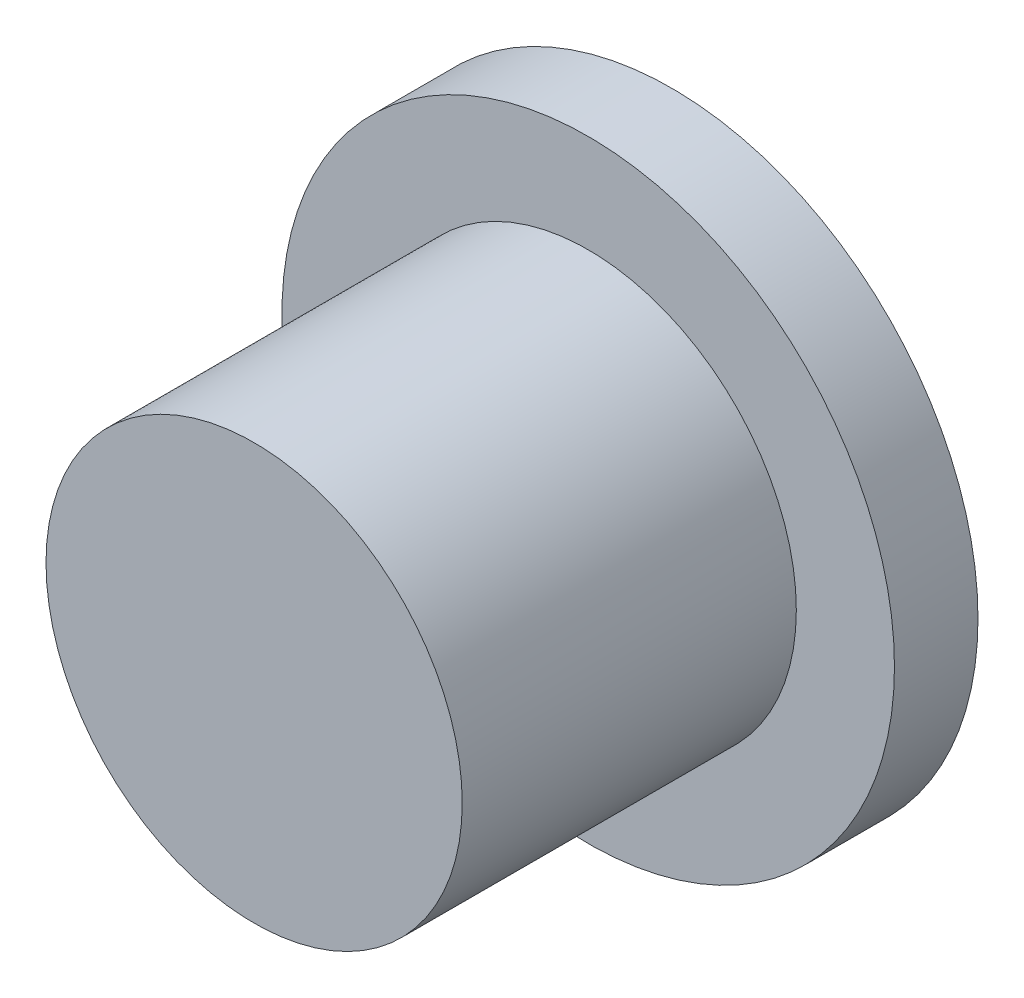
ISO-10303-21;
HEADER;
FILE_DESCRIPTION(('STEP AP214'),'2;1');
FILE_NAME('part.step','',(''),(''),'','','');
FILE_SCHEMA(('AUTOMOTIVE_DESIGN { 1 0 10303 214 1 1 1 1 }'));
ENDSEC;
DATA;
#1=APPLICATION_CONTEXT('core data for automotive mechanical design processes');
#2=APPLICATION_PROTOCOL_DEFINITION('international standard','automotive_design',2000,#1);
#3=PRODUCT_CONTEXT('',#1,'mechanical');
#4=PRODUCT('Part','Part','',(#3));
#5=PRODUCT_RELATED_PRODUCT_CATEGORY('part','',(#4));
#6=PRODUCT_DEFINITION_FORMATION('','',#4);
#7=PRODUCT_DEFINITION_CONTEXT('part definition',#1,'design');
#8=PRODUCT_DEFINITION('design','',#6,#7);
#9=PRODUCT_DEFINITION_SHAPE('','',#8);
#10=(LENGTH_UNIT() NAMED_UNIT(*) SI_UNIT(.MILLI.,.METRE.));
#11=(NAMED_UNIT(*) PLANE_ANGLE_UNIT() SI_UNIT($,.RADIAN.));
#12=(NAMED_UNIT(*) SI_UNIT($,.STERADIAN.) SOLID_ANGLE_UNIT());
#13=UNCERTAINTY_MEASURE_WITH_UNIT(LENGTH_MEASURE(1.E-05),#10,'distance_accuracy_value','');
#14=(GEOMETRIC_REPRESENTATION_CONTEXT(3) GLOBAL_UNCERTAINTY_ASSIGNED_CONTEXT((#13)) GLOBAL_UNIT_ASSIGNED_CONTEXT((#10,
#11,#12)) REPRESENTATION_CONTEXT('',''));
#15=CARTESIAN_POINT('',(0.,0.,0.));
#16=DIRECTION('',(0.,0.,1.));
#17=DIRECTION('',(1.,0.,0.));
#18=AXIS2_PLACEMENT_3D('',#15,#16,#17);
#19=CARTESIAN_POINT('',(0.,11.,-3.));
#20=DIRECTION('',(0.,0.,1.));
#21=DIRECTION('',(1.,0.,0.));
#22=AXIS2_PLACEMENT_3D('',#19,#20,#21);
#23=PLANE('',#22);
#24=CARTESIAN_POINT('',(0.,0.,-3.));
#25=DIRECTION('',(0.,0.,1.));
#26=DIRECTION('',(1.,0.,0.));
#27=AXIS2_PLACEMENT_3D('',#24,#25,#26);
#28=CIRCLE('',#27,11.);
#29=CARTESIAN_POINT('',(11.,0.,-3.));
#30=VERTEX_POINT('',#29);
#31=EDGE_CURVE('E141',#30,#30,#28,.T.);
#32=ORIENTED_EDGE('',*,*,#31,.F.);
#33=EDGE_LOOP('',(#32));
#34=FACE_BOUND('',#33,.T.);
#35=DIRECTION('',(-0.866025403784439,0.5,0.));
#36=VECTOR('',#35,1.);
#37=CARTESIAN_POINT('',(4.,2.3094010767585,-3.));
#38=LINE('',#37,#36);
#39=CARTESIAN_POINT('',(4.,2.3094010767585,-3.));
#40=VERTEX_POINT('',#39);
#41=CARTESIAN_POINT('',(0.,4.61880215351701,-3.));
#42=VERTEX_POINT('',#41);
#43=EDGE_CURVE('E50',#40,#42,#38,.T.);
#44=ORIENTED_EDGE('',*,*,#43,.T.);
#45=DIRECTION('',(-0.866025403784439,-0.5,0.));
#46=VECTOR('',#45,1.);
#47=CARTESIAN_POINT('',(0.,4.61880215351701,-3.));
#48=LINE('',#47,#46);
#49=CARTESIAN_POINT('',(-4.,2.3094010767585,-3.));
#50=VERTEX_POINT('',#49);
#51=EDGE_CURVE('E121',#42,#50,#48,.T.);
#52=ORIENTED_EDGE('',*,*,#51,.T.);
#53=DIRECTION('',(0.,-1.,0.));
#54=VECTOR('',#53,1.);
#55=CARTESIAN_POINT('',(-4.,2.3094010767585,-3.));
#56=LINE('',#55,#54);
#57=CARTESIAN_POINT('',(-4.,-2.3094010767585,-3.));
#58=VERTEX_POINT('',#57);
#59=EDGE_CURVE('E124',#50,#58,#56,.T.);
#60=ORIENTED_EDGE('',*,*,#59,.T.);
#61=DIRECTION('',(0.866025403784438,-0.5,0.));
#62=VECTOR('',#61,1.);
#63=CARTESIAN_POINT('',(-4.,-2.3094010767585,-3.));
#64=LINE('',#63,#62);
#65=CARTESIAN_POINT('',(0.,-4.61880215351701,-3.));
#66=VERTEX_POINT('',#65);
#67=EDGE_CURVE('E127',#58,#66,#64,.T.);
#68=ORIENTED_EDGE('',*,*,#67,.T.);
#69=DIRECTION('',(0.866025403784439,0.5,0.));
#70=VECTOR('',#69,1.);
#71=CARTESIAN_POINT('',(0.,-4.61880215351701,-3.));
#72=LINE('',#71,#70);
#73=CARTESIAN_POINT('',(4.,-2.3094010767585,-3.));
#74=VERTEX_POINT('',#73);
#75=EDGE_CURVE('E111',#66,#74,#72,.T.);
#76=ORIENTED_EDGE('',*,*,#75,.T.);
#77=DIRECTION('',(0.,1.,0.));
#78=VECTOR('',#77,1.);
#79=CARTESIAN_POINT('',(4.,-2.3094010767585,-3.));
#80=LINE('',#79,#78);
#81=EDGE_CURVE('E130',#74,#40,#80,.T.);
#82=ORIENTED_EDGE('',*,*,#81,.T.);
#83=EDGE_LOOP('',(#44,#52,#60,#68,#76,#82));
#84=FACE_BOUND('',#83,.T.);
#85=ADVANCED_FACE('F35',(#34,#84),#23,.F.);
#86=CARTESIAN_POINT('',(0.,0.,12.));
#87=DIRECTION('',(0.,0.,-1.));
#88=DIRECTION('',(-1.,0.,0.));
#89=AXIS2_PLACEMENT_3D('',#86,#87,#88);
#90=PLANE('',#89);
#91=CARTESIAN_POINT('',(0.,0.,12.));
#92=DIRECTION('',(0.,0.,1.));
#93=DIRECTION('',(1.,0.,0.));
#94=AXIS2_PLACEMENT_3D('',#91,#92,#93);
#95=CIRCLE('',#94,7.475);
#96=CARTESIAN_POINT('',(7.475,0.,12.));
#97=VERTEX_POINT('',#96);
#98=EDGE_CURVE('E11',#97,#97,#95,.T.);
#99=ORIENTED_EDGE('',*,*,#98,.T.);
#100=EDGE_LOOP('',(#99));
#101=FACE_BOUND('',#100,.T.);
#102=ADVANCED_FACE('F37',(#101),#90,.F.);
#103=CARTESIAN_POINT('',(0.,0.,65.7239594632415));
#104=DIRECTION('',(0.,0.,1.));
#105=DIRECTION('',(1.,0.,0.));
#106=AXIS2_PLACEMENT_3D('',#103,#104,#105);
#107=CYLINDRICAL_SURFACE('',#106,7.475);
#108=ORIENTED_EDGE('',*,*,#98,.F.);
#109=EDGE_LOOP('',(#108));
#110=FACE_BOUND('',#109,.T.);
#111=CARTESIAN_POINT('',(0.,0.,0.));
#112=DIRECTION('',(0.,0.,1.));
#113=DIRECTION('',(1.,0.,0.));
#114=AXIS2_PLACEMENT_3D('',#111,#112,#113);
#115=CIRCLE('',#114,7.475);
#116=CARTESIAN_POINT('',(7.475,0.,0.));
#117=VERTEX_POINT('',#116);
#118=EDGE_CURVE('E43',#117,#117,#115,.T.);
#119=ORIENTED_EDGE('',*,*,#118,.T.);
#120=EDGE_LOOP('',(#119));
#121=FACE_BOUND('',#120,.T.);
#122=ADVANCED_FACE('F149',(#110,#121),#107,.T.);
#123=CARTESIAN_POINT('',(0.,11.,0.));
#124=DIRECTION('',(0.,0.,-1.));
#125=DIRECTION('',(-1.,0.,0.));
#126=AXIS2_PLACEMENT_3D('',#123,#124,#125);
#127=PLANE('',#126);
#128=ORIENTED_EDGE('',*,*,#118,.F.);
#129=EDGE_LOOP('',(#128));
#130=FACE_BOUND('',#129,.T.);
#131=CARTESIAN_POINT('',(0.,0.,0.));
#132=DIRECTION('',(0.,0.,1.));
#133=DIRECTION('',(1.,0.,0.));
#134=AXIS2_PLACEMENT_3D('',#131,#132,#133);
#135=CIRCLE('',#134,11.);
#136=CARTESIAN_POINT('',(11.,0.,0.));
#137=VERTEX_POINT('',#136);
#138=EDGE_CURVE('E144',#137,#137,#135,.T.);
#139=ORIENTED_EDGE('',*,*,#138,.T.);
#140=EDGE_LOOP('',(#139));
#141=FACE_BOUND('',#140,.T.);
#142=ADVANCED_FACE('F151',(#130,#141),#127,.F.);
#143=CARTESIAN_POINT('',(0.,0.,65.7239594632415));
#144=DIRECTION('',(0.,0.,1.));
#145=DIRECTION('',(1.,0.,0.));
#146=AXIS2_PLACEMENT_3D('',#143,#144,#145);
#147=CYLINDRICAL_SURFACE('',#146,11.);
#148=ORIENTED_EDGE('',*,*,#138,.F.);
#149=EDGE_LOOP('',(#148));
#150=FACE_BOUND('',#149,.T.);
#151=ORIENTED_EDGE('',*,*,#31,.T.);
#152=EDGE_LOOP('',(#151));
#153=FACE_BOUND('',#152,.T.);
#154=ADVANCED_FACE('F154',(#150,#153),#147,.T.);
#155=CARTESIAN_POINT('',(4.,2.3094010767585,4.5));
#156=DIRECTION('',(-0.5,-0.866025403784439,0.));
#157=DIRECTION('',(0.866025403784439,-0.5,0.));
#158=AXIS2_PLACEMENT_3D('',#155,#156,#157);
#159=PLANE('',#158);
#160=ORIENTED_EDGE('',*,*,#43,.F.);
#161=DIRECTION('',(0.,0.,-1.));
#162=VECTOR('',#161,1.);
#163=CARTESIAN_POINT('',(4.,2.3094010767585,4.5));
#164=LINE('',#163,#162);
#165=CARTESIAN_POINT('',(4.,2.3094010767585,4.5));
#166=VERTEX_POINT('',#165);
#167=EDGE_CURVE('E116',#166,#40,#164,.T.);
#168=ORIENTED_EDGE('',*,*,#167,.F.);
#169=DIRECTION('',(-0.866025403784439,0.5,0.));
#170=VECTOR('',#169,1.);
#171=CARTESIAN_POINT('',(4.,2.3094010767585,4.5));
#172=LINE('',#171,#170);
#173=CARTESIAN_POINT('',(0.,4.61880215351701,4.5));
#174=VERTEX_POINT('',#173);
#175=EDGE_CURVE('E133',#166,#174,#172,.T.);
#176=ORIENTED_EDGE('',*,*,#175,.T.);
#177=DIRECTION('',(0.,0.,-1.));
#178=VECTOR('',#177,1.);
#179=CARTESIAN_POINT('',(0.,4.61880215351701,4.5));
#180=LINE('',#179,#178);
#181=EDGE_CURVE('E139',#174,#42,#180,.T.);
#182=ORIENTED_EDGE('',*,*,#181,.T.);
#183=EDGE_LOOP('',(#160,#168,#176,#182));
#184=FACE_BOUND('',#183,.T.);
#185=ADVANCED_FACE('F160',(#184),#159,.T.);
#186=CARTESIAN_POINT('',(0.,4.61880215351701,4.5));
#187=DIRECTION('',(0.5,-0.866025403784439,0.));
#188=DIRECTION('',(0.866025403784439,0.5,0.));
#189=AXIS2_PLACEMENT_3D('',#186,#187,#188);
#190=PLANE('',#189);
#191=ORIENTED_EDGE('',*,*,#51,.F.);
#192=ORIENTED_EDGE('',*,*,#181,.F.);
#193=DIRECTION('',(-0.866025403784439,-0.5,0.));
#194=VECTOR('',#193,1.);
#195=CARTESIAN_POINT('',(0.,4.61880215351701,4.5));
#196=LINE('',#195,#194);
#197=CARTESIAN_POINT('',(-4.,2.3094010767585,4.5));
#198=VERTEX_POINT('',#197);
#199=EDGE_CURVE('E89',#174,#198,#196,.T.);
#200=ORIENTED_EDGE('',*,*,#199,.T.);
#201=DIRECTION('',(0.,0.,-1.));
#202=VECTOR('',#201,1.);
#203=CARTESIAN_POINT('',(-4.,2.3094010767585,4.5));
#204=LINE('',#203,#202);
#205=EDGE_CURVE('E137',#198,#50,#204,.T.);
#206=ORIENTED_EDGE('',*,*,#205,.T.);
#207=EDGE_LOOP('',(#191,#192,#200,#206));
#208=FACE_BOUND('',#207,.T.);
#209=ADVANCED_FACE('F176',(#208),#190,.T.);
#210=CARTESIAN_POINT('',(-4.,2.3094010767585,4.5));
#211=DIRECTION('',(1.,0.,0.));
#212=DIRECTION('',(0.,0.,-1.));
#213=AXIS2_PLACEMENT_3D('',#210,#211,#212);
#214=PLANE('',#213);
#215=ORIENTED_EDGE('',*,*,#59,.F.);
#216=ORIENTED_EDGE('',*,*,#205,.F.);
#217=DIRECTION('',(0.,-1.,0.));
#218=VECTOR('',#217,1.);
#219=CARTESIAN_POINT('',(-4.,2.3094010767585,4.5));
#220=LINE('',#219,#218);
#221=CARTESIAN_POINT('',(-4.,-2.3094010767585,4.5));
#222=VERTEX_POINT('',#221);
#223=EDGE_CURVE('E107',#198,#222,#220,.T.);
#224=ORIENTED_EDGE('',*,*,#223,.T.);
#225=DIRECTION('',(0.,0.,-1.));
#226=VECTOR('',#225,1.);
#227=CARTESIAN_POINT('',(-4.,-2.3094010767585,4.5));
#228=LINE('',#227,#226);
#229=EDGE_CURVE('E104',#222,#58,#228,.T.);
#230=ORIENTED_EDGE('',*,*,#229,.T.);
#231=EDGE_LOOP('',(#215,#216,#224,#230));
#232=FACE_BOUND('',#231,.T.);
#233=ADVANCED_FACE('F174',(#232),#214,.T.);
#234=CARTESIAN_POINT('',(-4.,-2.3094010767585,4.5));
#235=DIRECTION('',(0.5,0.866025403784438,0.));
#236=DIRECTION('',(-0.866025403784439,0.5,0.));
#237=AXIS2_PLACEMENT_3D('',#234,#235,#236);
#238=PLANE('',#237);
#239=ORIENTED_EDGE('',*,*,#67,.F.);
#240=ORIENTED_EDGE('',*,*,#229,.F.);
#241=DIRECTION('',(0.866025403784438,-0.5,0.));
#242=VECTOR('',#241,1.);
#243=CARTESIAN_POINT('',(-4.,-2.3094010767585,4.5));
#244=LINE('',#243,#242);
#245=CARTESIAN_POINT('',(0.,-4.61880215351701,4.5));
#246=VERTEX_POINT('',#245);
#247=EDGE_CURVE('E99',#222,#246,#244,.T.);
#248=ORIENTED_EDGE('',*,*,#247,.T.);
#249=DIRECTION('',(0.,0.,-1.));
#250=VECTOR('',#249,1.);
#251=CARTESIAN_POINT('',(0.,-4.61880215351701,4.5));
#252=LINE('',#251,#250);
#253=EDGE_CURVE('E103',#246,#66,#252,.T.);
#254=ORIENTED_EDGE('',*,*,#253,.T.);
#255=EDGE_LOOP('',(#239,#240,#248,#254));
#256=FACE_BOUND('',#255,.T.);
#257=ADVANCED_FACE('F102',(#256),#238,.T.);
#258=CARTESIAN_POINT('',(0.,-4.61880215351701,4.5));
#259=DIRECTION('',(-0.5,0.866025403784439,0.));
#260=DIRECTION('',(-0.866025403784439,-0.5,0.));
#261=AXIS2_PLACEMENT_3D('',#258,#259,#260);
#262=PLANE('',#261);
#263=ORIENTED_EDGE('',*,*,#75,.F.);
#264=ORIENTED_EDGE('',*,*,#253,.F.);
#265=DIRECTION('',(0.866025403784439,0.5,0.));
#266=VECTOR('',#265,1.);
#267=CARTESIAN_POINT('',(0.,-4.61880215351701,4.5));
#268=LINE('',#267,#266);
#269=CARTESIAN_POINT('',(4.,-2.3094010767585,4.5));
#270=VERTEX_POINT('',#269);
#271=EDGE_CURVE('E106',#246,#270,#268,.T.);
#272=ORIENTED_EDGE('',*,*,#271,.T.);
#273=DIRECTION('',(0.,0.,-1.));
#274=VECTOR('',#273,1.);
#275=CARTESIAN_POINT('',(4.,-2.3094010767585,4.5));
#276=LINE('',#275,#274);
#277=EDGE_CURVE('E80',#270,#74,#276,.T.);
#278=ORIENTED_EDGE('',*,*,#277,.T.);
#279=EDGE_LOOP('',(#263,#264,#272,#278));
#280=FACE_BOUND('',#279,.T.);
#281=ADVANCED_FACE('F109',(#280),#262,.T.);
#282=CARTESIAN_POINT('',(4.,-2.3094010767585,4.5));
#283=DIRECTION('',(-1.,0.,0.));
#284=DIRECTION('',(0.,-1.,0.));
#285=AXIS2_PLACEMENT_3D('',#282,#283,#284);
#286=PLANE('',#285);
#287=ORIENTED_EDGE('',*,*,#81,.F.);
#288=ORIENTED_EDGE('',*,*,#277,.F.);
#289=DIRECTION('',(0.,1.,0.));
#290=VECTOR('',#289,1.);
#291=CARTESIAN_POINT('',(4.,-2.3094010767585,4.5));
#292=LINE('',#291,#290);
#293=EDGE_CURVE('E58',#270,#166,#292,.T.);
#294=ORIENTED_EDGE('',*,*,#293,.T.);
#295=ORIENTED_EDGE('',*,*,#167,.T.);
#296=EDGE_LOOP('',(#287,#288,#294,#295));
#297=FACE_BOUND('',#296,.T.);
#298=ADVANCED_FACE('F167',(#297),#286,.T.);
#299=CARTESIAN_POINT('',(4.,2.3094010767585,4.5));
#300=DIRECTION('',(0.,0.,-1.));
#301=DIRECTION('',(-1.,0.,0.));
#302=AXIS2_PLACEMENT_3D('',#299,#300,#301);
#303=PLANE('',#302);
#304=ORIENTED_EDGE('',*,*,#175,.F.);
#305=ORIENTED_EDGE('',*,*,#293,.F.);
#306=ORIENTED_EDGE('',*,*,#271,.F.);
#307=ORIENTED_EDGE('',*,*,#247,.F.);
#308=ORIENTED_EDGE('',*,*,#223,.F.);
#309=ORIENTED_EDGE('',*,*,#199,.F.);
#310=EDGE_LOOP('',(#304,#305,#306,#307,#308,#309));
#311=FACE_BOUND('',#310,.T.);
#312=ADVANCED_FACE('F114',(#311),#303,.T.);
#313=CLOSED_SHELL('',(#85,#102,#122,#142,#154,#185,#209,#233,#257,#281,#298,#312));
#314=MANIFOLD_SOLID_BREP('B2',#313);
#315=ADVANCED_BREP_SHAPE_REPRESENTATION('',(#18,#314),#14);
#316=SHAPE_DEFINITION_REPRESENTATION(#9,#315);
ENDSEC;
END-ISO-10303-21;
